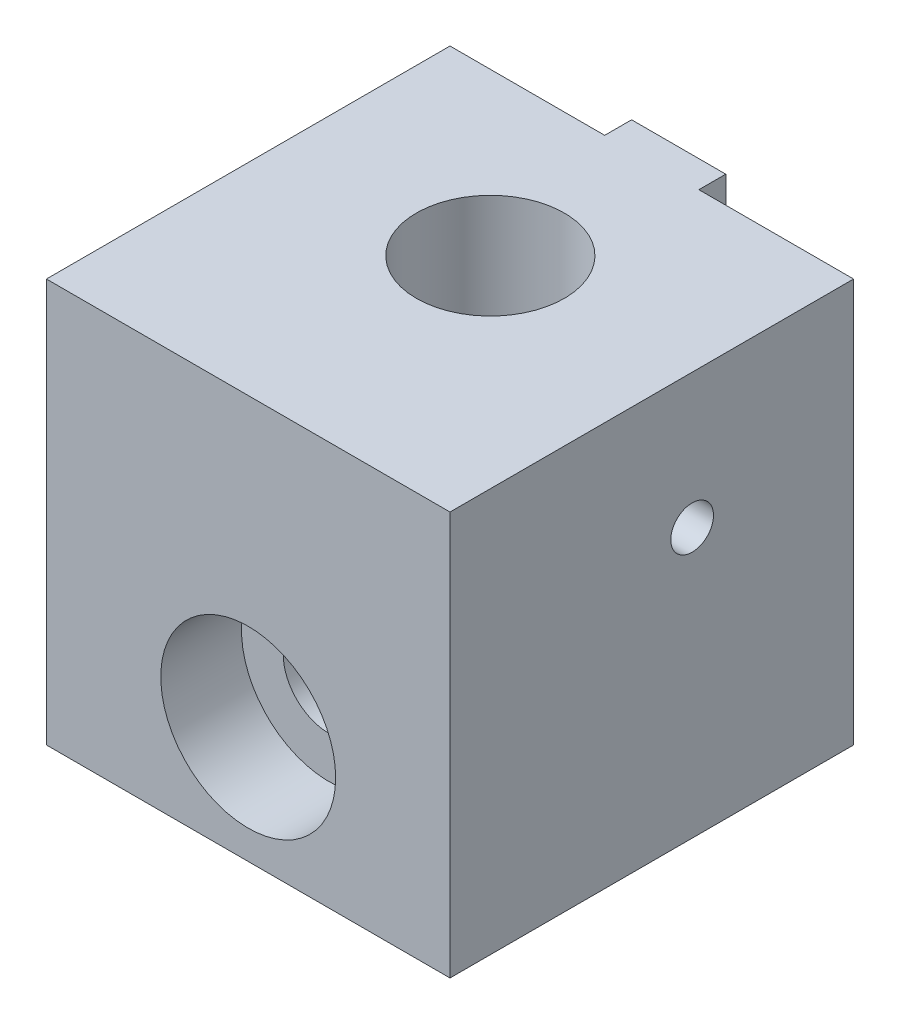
from build123d import *

# Parameters (mm, degrees)
SKETCH1_W                           = 15
SKETCH1_H                           = 15
BOSS_EXTRUDE1_DEPTH                 = 15
SKETCH8_W                           = 3.5
SKETCH8_H                           = 15
BOSS_EXTRUDE2_DEPTH                 = 1
CBORE_FOR_M3_SHCS1_D                = 3.4
CBORE_FOR_M3_SHCS1_CBORE_D          = 6.5
CBORE_FOR_M3_SHCS1_CBORE_DEPTH      = 3
SKETCH6_R                           = 2.75
CUT_EXTRUDE1_DEPTH                  = 8
F_1_16_0_0625_DIAMETER_HOLE1_REACH  = 24.5
F_1_16_0_0625_DIAMETER_HOLE1_BORE_R = 0.79375


with BuildPart() as part:
    # Sketch1 → Boss-Extrude1 (new body)
    with BuildSketch(Plane.XY):
        Rectangle(SKETCH1_W, SKETCH1_H)
    extrude(amount=BOSS_EXTRUDE1_DEPTH)

    # Sketch8 → Boss-Extrude2 (add)
    with BuildSketch(Plane(origin=(0, 0, 0), x_dir=(-1, 0, 0), z_dir=(0, 0, -1))):
        Rectangle(SKETCH8_W, SKETCH8_H)
    extrude(amount=BOSS_EXTRUDE2_DEPTH)

    # CBORE for M3 SHCS1 (through all)
    with Locations(Plane.XY.offset(15)):
        with Locations((0, -3.177833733)):
            CounterBoreHole(CBORE_FOR_M3_SHCS1_D / 2, CBORE_FOR_M3_SHCS1_CBORE_D / 2, CBORE_FOR_M3_SHCS1_CBORE_DEPTH)

    # Sketch6 → Cut-Extrude1 (cut)
    with BuildSketch(Plane(origin=(0, 7.5, 0), x_dir=(1, 0, 0), z_dir=(0, 1, 0))):
        with Locations(Location((0, -6, 0), (0, 0, 270))):
            Circle(SKETCH6_R)
    extrude(amount=-CUT_EXTRUDE1_DEPTH, mode=Mode.SUBTRACT)

    # 1_16 _0.0625_ Diameter Hole1 bore → 1_16 _0.0625_ Diameter Hole1 (cut, up to next)
    with BuildSketch(Plane(origin=(7.5, 0, 0), x_dir=(0, 0, -1), z_dir=(1, 0, 0)), mode=Mode.PRIVATE) as f_1_16_0_0625_diameter_hole1_sk1:
        with Locations((-6, 2.5)):
            Circle(F_1_16_0_0625_DIAMETER_HOLE1_BORE_R)
    f_1_16_0_0625_diameter_hole1_tool1 = extrude(f_1_16_0_0625_diameter_hole1_sk1.sketch, amount=-F_1_16_0_0625_DIAMETER_HOLE1_REACH, mode=Mode.PRIVATE) & part.part
    add(f_1_16_0_0625_diameter_hole1_tool1.solids().sort_by_distance((7.5, 2.5, 6))[0], mode=Mode.SUBTRACT)


solid = part.part
